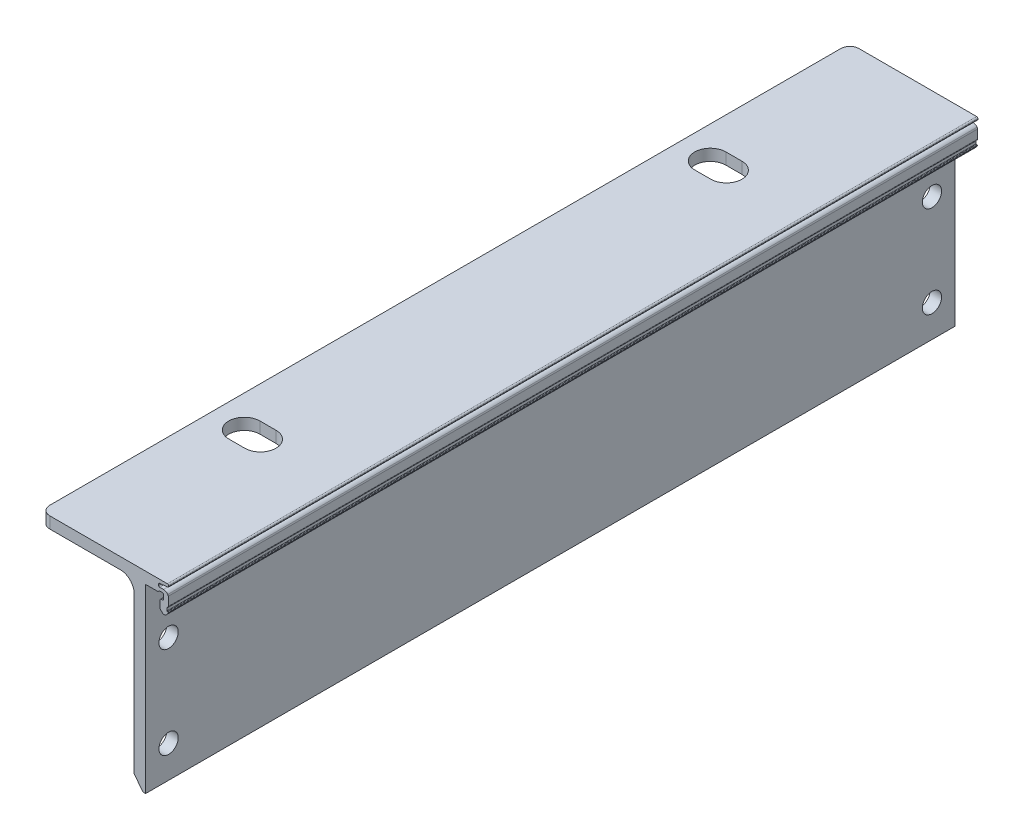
from build123d import *

# Parameters (mm, degrees)
EXTRUDE_1_DEPTH     = 88.225
FILLET_2_R          = 3
CUT_EXTRUDE_1_DEPTH = 2360.947754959
SKETCH_3_R          = 2.1
CUT_EXTRUDE_2_DEPTH = 3334.333968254
FILLET_1_R          = 2


with BuildPart() as part:
    # Sketch 1 → Extrude 1 (new, symmetric)
    with BuildSketch(Plane.XY):
        with BuildLine():
            Line((2329.984035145, -3290.103769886), (2355.384035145, -3290.103769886))
            Line((2355.384035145, -3290.103769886), (2357.624035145, -3290.103769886))
            ThreePointArc((2357.624035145, -3290.103769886), (2357.836167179, -3290.191637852), (2357.924035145, -3290.403769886))
            Line((2357.924035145, -3290.403769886), (2357.924035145, -3290.492459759))
            ThreePointArc((2357.924035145, -3290.492459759), (2357.87266411, -3290.626285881), (2357.744940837, -3290.691364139))
            Line((2357.744940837, -3290.691364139), (2355.903129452, -3290.884946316))
            ThreePointArc((2355.903129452, -3290.884946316), (2355.775406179, -3290.950024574), (2355.724035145, -3291.083850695))
            Line((2355.724035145, -3291.083850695), (2355.724035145, -3291.403769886))
            ThreePointArc((2355.724035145, -3291.403769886), (2355.782613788, -3291.545191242), (2355.924035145, -3291.603769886))
            Line((2355.924035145, -3291.603769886), (2356.769984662, -3291.603769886))
            ThreePointArc((2356.769984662, -3291.603769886), (2357.299096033, -3291.726717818), (2357.719785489, -3292.070367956))
            ThreePointArc((2357.719785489, -3292.070367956), (2357.797255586, -3292.214513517), (2357.824035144, -3292.375952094))
            Line((2357.824035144, -3292.375952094), (2357.824035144, -3294.273769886))
            ThreePointArc((2357.824035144, -3294.273769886), (2357.779946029, -3294.430325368), (2357.660637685, -3294.540864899))
            ThreePointArc((2357.660637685, -3294.540864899), (2357.54132934, -3294.65140443), (2357.497240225, -3294.807959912))
            Line((2357.497240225, -3294.807959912), (2357.497240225, -3295.307959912))
            ThreePointArc((2357.497240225, -3295.307959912), (2357.526529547, -3295.37867059), (2357.597240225, -3295.407959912))
            Line((2357.597240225, -3295.407959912), (2357.724035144, -3295.407959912))
            ThreePointArc((2357.724035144, -3295.407959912), (2357.794745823, -3295.437249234), (2357.824035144, -3295.507959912))
            Line((2357.824035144, -3295.507959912), (2357.824035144, -3295.527361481))
            ThreePointArc((2357.824035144, -3295.527361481), (2357.818000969, -3295.561572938), (2357.800626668, -3295.591655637))
            Line((2357.800626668, -3295.591655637), (2357.383057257, -3296.089092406))
            ThreePointArc((2357.383057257, -3296.089092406), (2356.924035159, -3296.303081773), (2356.465013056, -3296.089092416))
            Line((2356.465013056, -3296.089092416), (2356.094260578, -3295.647427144))
            ThreePointArc((2356.094260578, -3295.647427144), (2356.042137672, -3295.557179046), (2356.024035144, -3295.454544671))
            Line((2356.024035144, -3295.454544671), (2356.024035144, -3294.003769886))
            ThreePointArc((2356.024035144, -3294.003769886), (2356.11190311, -3293.791637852), (2356.324035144, -3293.703769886))
            Line((2356.324035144, -3293.703769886), (2356.524035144, -3293.703769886))
            ThreePointArc((2356.524035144, -3293.703769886), (2356.736167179, -3293.61590192), (2356.824035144, -3293.403769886))
            Line((2356.824035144, -3293.403769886), (2356.824035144, -3292.603769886))
            ThreePointArc((2356.824035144, -3292.603769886), (2356.736167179, -3292.391637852), (2356.524035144, -3292.303769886))
            Line((2356.524035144, -3292.303769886), (2355.987964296, -3292.303769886))
            ThreePointArc((2355.987964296, -3292.303769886), (2355.837964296, -3292.343962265), (2355.728156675, -3292.453769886))
            ThreePointArc((2355.728156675, -3292.453769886), (2355.618349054, -3292.563577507), (2355.468349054, -3292.603769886))
            Line((2355.468349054, -3292.603769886), (2355.384035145, -3292.603769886))
            Line((2355.384035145, -3292.603769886), (2352.884035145, -3292.603769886))
            Line((2352.884035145, -3292.603769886), (2352.884035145, -3332.103769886))
            Line((2352.884035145, -3332.103769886), (2352.284035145, -3332.103769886))
            Line((2352.284035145, -3332.103769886), (2350.384035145, -3329.603769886))
            Line((2350.384035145, -3329.603769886), (2350.384035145, -3292.603769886))
            Line((2350.384035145, -3292.603769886), (2329.984035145, -3292.603769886))
            Line((2329.984035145, -3292.603769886), (2329.984035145, -3290.103769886))
        make_face()
    extrude(amount=EXTRUDE_1_DEPTH, both=True)

    # Fillet 2
    fillet_2_edges = [part.edges().sort_by_distance(p)[0] for p in [
        (2350.384035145, -3292.603769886, 0),
    ]]
    fillet(fillet_2_edges, radius=FILLET_2_R)

    # Sketch 2 → Cut-Extrude 1 (cut, through all)
    with BuildSketch(Plane(origin=(0, -3290.103769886, 0), x_dir=(1, 0, 0), z_dir=(0, 1, 0))):
        with BuildLine():
            Line((2340.484035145, -47.4), (2336.984035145, -47.4))
            ThreePointArc((2336.984035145, -47.4), (2333.584035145, -50.8), (2336.984035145, -54.2))
            Line((2336.984035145, -54.2), (2340.484035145, -54.2))
            ThreePointArc((2340.484035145, -54.2), (2343.884035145, -50.8), (2340.484035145, -47.4))
        make_face()
        with BuildLine():
            Line((2340.484035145, 54.2), (2336.984035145, 54.2))
            ThreePointArc((2336.984035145, 54.2), (2333.584035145, 50.8), (2336.984035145, 47.4))
            Line((2336.984035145, 47.4), (2340.484035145, 47.4))
            ThreePointArc((2340.484035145, 47.4), (2343.884035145, 50.8), (2340.484035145, 54.2))
        make_face()
    extrude(amount=-CUT_EXTRUDE_1_DEPTH, mode=Mode.SUBTRACT)

    # Sketch 3 → Cut-Extrude 2 (cut, through all)
    with BuildSketch(Plane.ZY.offset(-2350.384035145)):
        with Locations(Location((-83.225, -3305.103769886, 0), (0, 0, 270))):
            Circle(SKETCH_3_R)
        with Locations(Location((-83.225, -3325.103769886, 0), (0, 0, 270))):
            Circle(SKETCH_3_R)
        with Locations((83.225, -3305.103769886)):
            Circle(SKETCH_3_R)
        with Locations((83.225, -3325.103769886)):
            Circle(SKETCH_3_R)
    extrude(amount=-CUT_EXTRUDE_2_DEPTH, mode=Mode.SUBTRACT)

    # Fillet 1
    fillet_1_edges = [part.edges().sort_by_distance(p)[0] for p in [
        (2329.984035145, -3291.353769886, 88.225),
        (2329.984035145, -3291.353769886, -88.225),
    ]]
    fillet(fillet_1_edges, radius=FILLET_1_R)


solid = part.part
